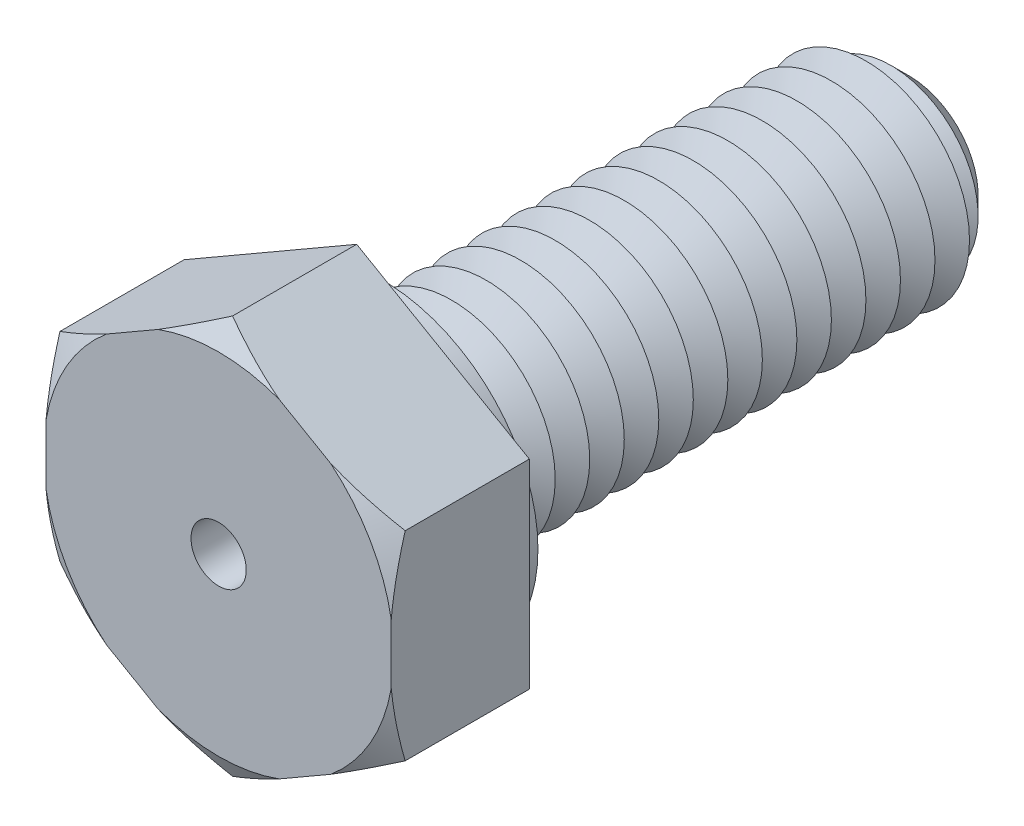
from build123d import *

# Parameters (mm, degrees)
BOSS_EXTRUDE1_DEPTH = 4
SKETCH3_R           = 3
BOSS_EXTRUDE2_DEPTH = 16
SKETCH4_R           = 4.5
BOSS_EXTRUDE3_DEPTH = 0.75
CHAMFER1_SIZE       = 1
LPATTERN1_COUNT     = 15
LPATTERN1_PITCH     = 1
SKETCH8_R           = 0.8
CUT_EXTRUDE1_DEPTH  = 20


with BuildPart() as part:
    # Sketch2 → Boss-Extrude1 (new body)
    with BuildSketch(Plane.XY):
        Polygon((0, 5.773502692), (-5, 2.886751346), (-5, -2.886751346), (0, -5.773502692), (5, -2.886751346), (5, 2.886751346), align=None)
    extrude(amount=BOSS_EXTRUDE1_DEPTH)

    # Sketch3 → Boss-Extrude2 (add)
    with BuildSketch(Plane(origin=(0, 0, 0), x_dir=(-1, 0, 0), z_dir=(0, 0, -1))):
        Circle(SKETCH3_R)
    extrude(amount=BOSS_EXTRUDE2_DEPTH)

    # Sketch4 → Boss-Extrude3 (add)
    with BuildSketch(Plane(origin=(0, 0, 0), x_dir=(-1, 0, 0), z_dir=(0, 0, -1))):
        with Locations(Location((0, 0, 0), (0, 0, 180))):
            Circle(SKETCH4_R)
    extrude(amount=BOSS_EXTRUDE3_DEPTH)

    # Chamfer1
    chamfer1_edges = [part.edges().sort_by_distance(p)[0] for p in [
        (3, 0, -16),
    ]]
    chamfer(chamfer1_edges, length=CHAMFER1_SIZE)

    # Sketch6 → Cut-Revolve1 (revolve, cut)
    with BuildSketch(Plane(origin=(0, 0, 0), x_dir=(0, 0, -1), z_dir=(1, 0, 0)), mode=Mode.PRIVATE) as cut_revolve1_sk:
        Polygon((0.75, 3), (1.25, 2.133974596), (1.75, 3), align=None)
    cut_revolve1 = revolve(cut_revolve1_sk.sketch.rotate(Axis((0, 0, 3.211670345), (0, 0, -1)), 90), axis=Axis((0, 0, 3.211670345), (0, 0, -1)), mode=Mode.SUBTRACT)

    # LPattern1: Cut-Revolve1 ×15
    with Locations(*[(0, 0, -i * LPATTERN1_PITCH) for i in range(1, LPATTERN1_COUNT)]):
        add(cut_revolve1, mode=Mode.SUBTRACT)

    # Sketch7 → Cut-Revolve2 (revolve, cut)
    with BuildSketch(Plane(origin=(0, 0, 0), x_dir=(0, 0, -1), z_dir=(1, 0, 0)), mode=Mode.PRIVATE) as cut_revolve2_sk:
        Polygon((-4, 5.773502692), (-4, 5.073502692), (-3.595854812, 5.773502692), align=None)
    revolve(cut_revolve2_sk.sketch.rotate(Axis((0, 0, 3.211670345), (0, 0, -1)), 270), axis=Axis((0, 0, 3.211670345), (0, 0, -1)), mode=Mode.SUBTRACT)

    # Sketch8 → Cut-Extrude1 (cut)
    with BuildSketch(Plane.XY.offset(4)):
        Circle(SKETCH8_R)
    extrude(amount=-CUT_EXTRUDE1_DEPTH, mode=Mode.SUBTRACT)


solid = part.part
